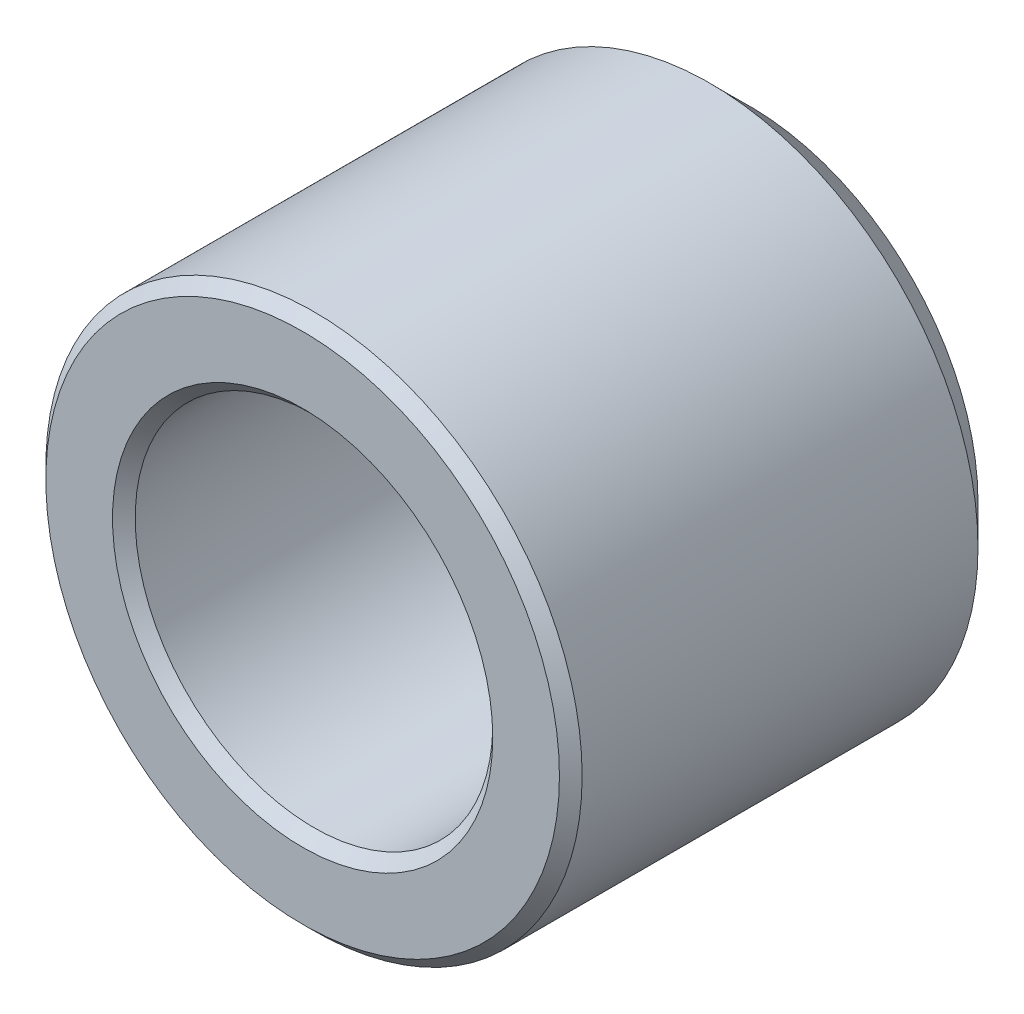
ISO-10303-21;
HEADER;
FILE_DESCRIPTION(('STEP AP214'),'2;1');
FILE_NAME('part.step','',(''),(''),'','','');
FILE_SCHEMA(('AUTOMOTIVE_DESIGN { 1 0 10303 214 1 1 1 1 }'));
ENDSEC;
DATA;
#1=APPLICATION_CONTEXT('core data for automotive mechanical design processes');
#2=APPLICATION_PROTOCOL_DEFINITION('international standard','automotive_design',2000,#1);
#3=PRODUCT_CONTEXT('',#1,'mechanical');
#4=PRODUCT('Part','Part','',(#3));
#5=PRODUCT_RELATED_PRODUCT_CATEGORY('part','',(#4));
#6=PRODUCT_DEFINITION_FORMATION('','',#4);
#7=PRODUCT_DEFINITION_CONTEXT('part definition',#1,'design');
#8=PRODUCT_DEFINITION('design','',#6,#7);
#9=PRODUCT_DEFINITION_SHAPE('','',#8);
#10=(LENGTH_UNIT() NAMED_UNIT(*) SI_UNIT(.MILLI.,.METRE.));
#11=(NAMED_UNIT(*) PLANE_ANGLE_UNIT() SI_UNIT($,.RADIAN.));
#12=(NAMED_UNIT(*) SI_UNIT($,.STERADIAN.) SOLID_ANGLE_UNIT());
#13=UNCERTAINTY_MEASURE_WITH_UNIT(LENGTH_MEASURE(1.E-05),#10,'distance_accuracy_value','');
#14=(GEOMETRIC_REPRESENTATION_CONTEXT(3) GLOBAL_UNCERTAINTY_ASSIGNED_CONTEXT((#13)) GLOBAL_UNIT_ASSIGNED_CONTEXT((#10,
#11,#12)) REPRESENTATION_CONTEXT('',''));
#15=CARTESIAN_POINT('',(0.,0.,0.));
#16=DIRECTION('',(0.,0.,1.));
#17=DIRECTION('',(1.,0.,0.));
#18=AXIS2_PLACEMENT_3D('',#15,#16,#17);
#19=CARTESIAN_POINT('',(0.,0.,10.));
#20=DIRECTION('',(0.,0.,1.));
#21=DIRECTION('',(1.,0.,0.));
#22=AXIS2_PLACEMENT_3D('',#19,#20,#21);
#23=CYLINDRICAL_SURFACE('',#22,2.25);
#24=CARTESIAN_POINT('',(0.,0.,0.254));
#25=DIRECTION('',(0.,0.,1.));
#26=DIRECTION('',(1.,0.,0.));
#27=AXIS2_PLACEMENT_3D('',#24,#25,#26);
#28=CIRCLE('',#27,2.25);
#29=CARTESIAN_POINT('',(2.25,0.,0.254));
#30=VERTEX_POINT('',#29);
#31=EDGE_CURVE('E8',#30,#30,#28,.F.);
#32=ORIENTED_EDGE('',*,*,#31,.T.);
#33=EDGE_LOOP('',(#32));
#34=FACE_BOUND('',#33,.T.);
#35=CARTESIAN_POINT('',(0.,0.,4.));
#36=DIRECTION('',(0.,0.,1.));
#37=DIRECTION('',(1.,0.,0.));
#38=AXIS2_PLACEMENT_3D('',#35,#36,#37);
#39=CIRCLE('',#38,2.25);
#40=CARTESIAN_POINT('',(2.25,0.,4.));
#41=VERTEX_POINT('',#40);
#42=EDGE_CURVE('E16',#41,#41,#39,.F.);
#43=ORIENTED_EDGE('',*,*,#42,.F.);
#44=EDGE_LOOP('',(#43));
#45=FACE_BOUND('',#44,.T.);
#46=ADVANCED_FACE('F12',(#34,#45),#23,.F.);
#47=CARTESIAN_POINT('',(0.,0.,0.));
#48=DIRECTION('',(0.,0.,1.));
#49=DIRECTION('',(1.,0.,0.));
#50=AXIS2_PLACEMENT_3D('',#47,#48,#49);
#51=CYLINDRICAL_SURFACE('',#50,6.);
#52=CARTESIAN_POINT('',(0.,0.,0.889));
#53=DIRECTION('',(0.,0.,1.));
#54=DIRECTION('',(1.,0.,0.));
#55=AXIS2_PLACEMENT_3D('',#52,#53,#54);
#56=CIRCLE('',#55,6.);
#57=CARTESIAN_POINT('',(6.,0.,0.889));
#58=VERTEX_POINT('',#57);
#59=EDGE_CURVE('E35',#58,#58,#56,.T.);
#60=ORIENTED_EDGE('',*,*,#59,.T.);
#61=EDGE_LOOP('',(#60));
#62=FACE_BOUND('',#61,.T.);
#63=CARTESIAN_POINT('',(0.,0.,9.746));
#64=DIRECTION('',(0.,0.,1.));
#65=DIRECTION('',(1.,0.,0.));
#66=AXIS2_PLACEMENT_3D('',#63,#64,#65);
#67=CIRCLE('',#66,6.);
#68=CARTESIAN_POINT('',(6.,0.,9.746));
#69=VERTEX_POINT('',#68);
#70=EDGE_CURVE('E38',#69,#69,#67,.F.);
#71=ORIENTED_EDGE('',*,*,#70,.T.);
#72=EDGE_LOOP('',(#71));
#73=FACE_BOUND('',#72,.T.);
#74=ADVANCED_FACE('F54',(#62,#73),#51,.T.);
#75=CARTESIAN_POINT('',(0.,0.,0.));
#76=DIRECTION('',(0.,0.,1.));
#77=DIRECTION('',(1.,0.,0.));
#78=AXIS2_PLACEMENT_3D('',#75,#76,#77);
#79=PLANE('',#78);
#80=CARTESIAN_POINT('',(0.,0.,0.));
#81=DIRECTION('',(0.,0.,1.));
#82=DIRECTION('',(1.,0.,0.));
#83=AXIS2_PLACEMENT_3D('',#80,#81,#82);
#84=CIRCLE('',#83,2.504);
#85=CARTESIAN_POINT('',(2.504,0.,0.));
#86=VERTEX_POINT('',#85);
#87=EDGE_CURVE('E20',#86,#86,#84,.T.);
#88=ORIENTED_EDGE('',*,*,#87,.T.);
#89=EDGE_LOOP('',(#88));
#90=FACE_BOUND('',#89,.T.);
#91=CARTESIAN_POINT('',(0.,0.,0.));
#92=DIRECTION('',(0.,0.,1.));
#93=DIRECTION('',(1.,0.,0.));
#94=AXIS2_PLACEMENT_3D('',#91,#92,#93);
#95=CIRCLE('',#94,5.111);
#96=CARTESIAN_POINT('',(5.111,0.,0.));
#97=VERTEX_POINT('',#96);
#98=EDGE_CURVE('E32',#97,#97,#95,.F.);
#99=ORIENTED_EDGE('',*,*,#98,.T.);
#100=EDGE_LOOP('',(#99));
#101=FACE_BOUND('',#100,.T.);
#102=ADVANCED_FACE('F60',(#90,#101),#79,.F.);
#103=CARTESIAN_POINT('',(0.,0.,10.));
#104=DIRECTION('',(0.,0.,1.));
#105=DIRECTION('',(1.,0.,0.));
#106=AXIS2_PLACEMENT_3D('',#103,#104,#105);
#107=PLANE('',#106);
#108=CARTESIAN_POINT('',(0.,0.,10.));
#109=DIRECTION('',(0.,0.,1.));
#110=DIRECTION('',(1.,0.,0.));
#111=AXIS2_PLACEMENT_3D('',#108,#109,#110);
#112=CIRCLE('',#111,4.254);
#113=CARTESIAN_POINT('',(4.254,0.,10.));
#114=VERTEX_POINT('',#113);
#115=EDGE_CURVE('E24',#114,#114,#112,.F.);
#116=ORIENTED_EDGE('',*,*,#115,.T.);
#117=EDGE_LOOP('',(#116));
#118=FACE_BOUND('',#117,.T.);
#119=CARTESIAN_POINT('',(0.,0.,10.));
#120=DIRECTION('',(0.,0.,1.));
#121=DIRECTION('',(1.,0.,0.));
#122=AXIS2_PLACEMENT_3D('',#119,#120,#121);
#123=CIRCLE('',#122,5.746);
#124=CARTESIAN_POINT('',(5.746,0.,10.));
#125=VERTEX_POINT('',#124);
#126=EDGE_CURVE('E41',#125,#125,#123,.T.);
#127=ORIENTED_EDGE('',*,*,#126,.T.);
#128=EDGE_LOOP('',(#127));
#129=FACE_BOUND('',#128,.T.);
#130=ADVANCED_FACE('F69',(#118,#129),#107,.T.);
#131=CARTESIAN_POINT('',(0.,0.,10.));
#132=DIRECTION('',(0.,0.,-1.));
#133=DIRECTION('',(-1.,0.,0.));
#134=AXIS2_PLACEMENT_3D('',#131,#132,#133);
#135=CONICAL_SURFACE('',#134,5.746,0.78539816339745);
#136=ORIENTED_EDGE('',*,*,#70,.F.);
#137=EDGE_LOOP('',(#136));
#138=FACE_BOUND('',#137,.T.);
#139=ORIENTED_EDGE('',*,*,#126,.F.);
#140=EDGE_LOOP('',(#139));
#141=FACE_BOUND('',#140,.T.);
#142=ADVANCED_FACE('F72',(#138,#141),#135,.T.);
#143=CARTESIAN_POINT('',(0.,0.,0.889));
#144=DIRECTION('',(0.,0.,1.));
#145=DIRECTION('',(1.,0.,0.));
#146=AXIS2_PLACEMENT_3D('',#143,#144,#145);
#147=CONICAL_SURFACE('',#146,6.,0.78539816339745);
#148=ORIENTED_EDGE('',*,*,#98,.F.);
#149=EDGE_LOOP('',(#148));
#150=FACE_BOUND('',#149,.T.);
#151=ORIENTED_EDGE('',*,*,#59,.F.);
#152=EDGE_LOOP('',(#151));
#153=FACE_BOUND('',#152,.T.);
#154=ADVANCED_FACE('F77',(#150,#153),#147,.T.);
#155=CARTESIAN_POINT('',(0.,0.,10.));
#156=DIRECTION('',(0.,0.,1.));
#157=DIRECTION('',(1.,0.,0.));
#158=AXIS2_PLACEMENT_3D('',#155,#156,#157);
#159=CYLINDRICAL_SURFACE('',#158,4.);
#160=CARTESIAN_POINT('',(0.,0.,9.746));
#161=DIRECTION('',(0.,0.,1.));
#162=DIRECTION('',(1.,0.,0.));
#163=AXIS2_PLACEMENT_3D('',#160,#161,#162);
#164=CIRCLE('',#163,4.);
#165=CARTESIAN_POINT('',(4.,0.,9.746));
#166=VERTEX_POINT('',#165);
#167=EDGE_CURVE('E29',#166,#166,#164,.T.);
#168=ORIENTED_EDGE('',*,*,#167,.T.);
#169=EDGE_LOOP('',(#168));
#170=FACE_BOUND('',#169,.T.);
#171=CARTESIAN_POINT('',(0.,0.,4.));
#172=DIRECTION('',(0.,0.,1.));
#173=DIRECTION('',(1.,0.,0.));
#174=AXIS2_PLACEMENT_3D('',#171,#172,#173);
#175=CIRCLE('',#174,4.);
#176=CARTESIAN_POINT('',(4.,0.,4.));
#177=VERTEX_POINT('',#176);
#178=EDGE_CURVE('E44',#177,#177,#175,.T.);
#179=ORIENTED_EDGE('',*,*,#178,.F.);
#180=EDGE_LOOP('',(#179));
#181=FACE_BOUND('',#180,.T.);
#182=ADVANCED_FACE('F65',(#170,#181),#159,.F.);
#183=CARTESIAN_POINT('',(0.,0.,9.746));
#184=DIRECTION('',(0.,0.,1.));
#185=DIRECTION('',(1.,0.,0.));
#186=AXIS2_PLACEMENT_3D('',#183,#184,#185);
#187=CONICAL_SURFACE('',#186,4.,0.785398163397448);
#188=ORIENTED_EDGE('',*,*,#115,.F.);
#189=EDGE_LOOP('',(#188));
#190=FACE_BOUND('',#189,.T.);
#191=ORIENTED_EDGE('',*,*,#167,.F.);
#192=EDGE_LOOP('',(#191));
#193=FACE_BOUND('',#192,.T.);
#194=ADVANCED_FACE('F81',(#190,#193),#187,.F.);
#195=CARTESIAN_POINT('',(0.,0.,0.));
#196=DIRECTION('',(0.,0.,-1.));
#197=DIRECTION('',(-1.,0.,0.));
#198=AXIS2_PLACEMENT_3D('',#195,#196,#197);
#199=CONICAL_SURFACE('',#198,2.504,0.785398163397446);
#200=ORIENTED_EDGE('',*,*,#31,.F.);
#201=EDGE_LOOP('',(#200));
#202=FACE_BOUND('',#201,.T.);
#203=ORIENTED_EDGE('',*,*,#87,.F.);
#204=EDGE_LOOP('',(#203));
#205=FACE_BOUND('',#204,.T.);
#206=ADVANCED_FACE('F14',(#202,#205),#199,.F.);
#207=CARTESIAN_POINT('',(0.,0.,4.));
#208=DIRECTION('',(0.,0.,1.));
#209=DIRECTION('',(1.,0.,0.));
#210=AXIS2_PLACEMENT_3D('',#207,#208,#209);
#211=PLANE('',#210);
#212=ORIENTED_EDGE('',*,*,#178,.T.);
#213=EDGE_LOOP('',(#212));
#214=FACE_BOUND('',#213,.T.);
#215=ORIENTED_EDGE('',*,*,#42,.T.);
#216=EDGE_LOOP('',(#215));
#217=FACE_BOUND('',#216,.T.);
#218=ADVANCED_FACE('F51',(#214,#217),#211,.T.);
#219=CLOSED_SHELL('',(#46,#74,#102,#130,#142,#154,#182,#194,#206,#218));
#220=MANIFOLD_SOLID_BREP('B1',#219);
#221=ADVANCED_BREP_SHAPE_REPRESENTATION('',(#18,#220),#14);
#222=SHAPE_DEFINITION_REPRESENTATION(#9,#221);
ENDSEC;
END-ISO-10303-21;
